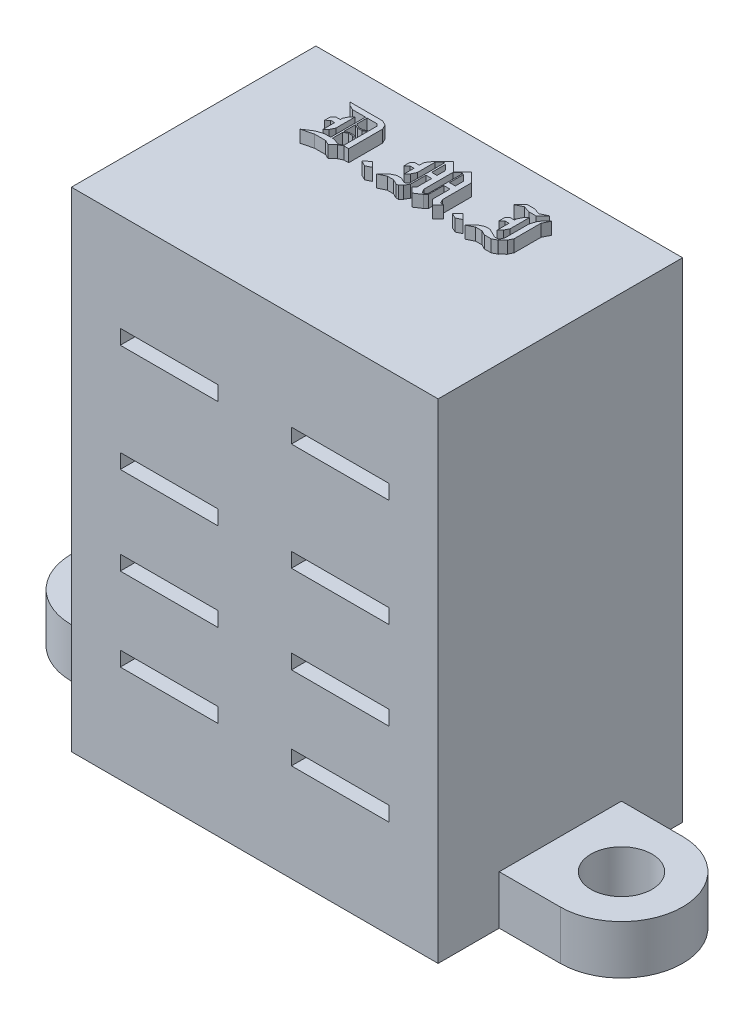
from build123d import *

# Parameters (mm, degrees)
EXTRUDE2_DEPTH     = 10
SKETCH5_R          = 1.25
CUT_EXTRUDE4_DEPTH = 26.617376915
EXTRUDE30_DEPTH    = 0.5
SKETCH3_W          = 4
SKETCH3_H          = 0.6
CUT_EXTRUDE7_DEPTH = 27.009613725


with BuildPart() as part:
    # Sketch1 → Extrude2 (new body)
    with BuildSketch(Plane.XY):
        Polygon((-12.5, 0), (12.5, 0), (12.5, 2), (7.5, 2), (7.5, 20), (-7.5, 20), (-7.5, 2), (-12.5, 2), align=None)
    extrude(amount=-EXTRUDE2_DEPTH)

    # Sketch5 → Cut-Extrude4 (cut, through all)
    with BuildSketch(Plane.XZ):
        with BuildLine():
            ThreePointArc((-12.5, -5), (-11.767766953, -3.232233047), (-10, -2.5))
            Line((-10, -2.5), (-7.5, -2.5))
            Line((-7.5, -2.5), (-7.5, 0))
            Line((-7.5, 0), (-12.5, 0))
            Line((-12.5, 0), (-12.5, -5))
        make_face()
        with BuildLine():
            ThreePointArc((-10, -7.5), (-11.767766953, -6.767766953), (-12.5, -5))
            Line((-12.5, -5), (-12.5, -10))
            Line((-12.5, -10), (-7.5, -10))
            Line((-7.5, -10), (-7.5, -7.5))
            Line((-7.5, -7.5), (-10, -7.5))
        make_face()
        with BuildLine():
            Line((12.5, 0), (7.5, 0))
            Line((7.5, 0), (7.5, -2.5))
            Line((7.5, -2.5), (10, -2.5))
            ThreePointArc((10, -2.5), (11.767766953, -3.232233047), (12.5, -5))
            Line((12.5, -5), (12.5, 0))
        make_face()
        with BuildLine():
            Line((7.5, -7.5), (7.5, -10))
            Line((7.5, -10), (12.5, -10))
            Line((12.5, -10), (12.5, -5))
            ThreePointArc((12.5, -5), (11.767766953, -6.767766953), (10, -7.5))
            Line((10, -7.5), (7.5, -7.5))
        make_face()
        with Locations(Location((-10, -5, 0), (0, 0, 180))):
            Circle(SKETCH5_R)
        with Locations(Location((10, -5, 0), (0, 0, 180))):
            Circle(SKETCH5_R)
    extrude(amount=-CUT_EXTRUDE4_DEPTH, mode=Mode.SUBTRACT)

    # Sketch26 → Extrude30 (add)
    # profile 1 of 8: a face of its own
    with BuildSketch(Plane(origin=(0, 20, 0), x_dir=(1, 0, 0), z_dir=(0, 1, 0))):
        with BuildLine():
            Line((-2.693472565, 6.534178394), (-2.89213957, 6.534178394))
            Line((-2.89213957, 6.534178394), (-3.067011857, 6.445042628))
            Line((-3.067011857, 6.445042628), (-3.2569919, 6.256951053))
            Line((-3.2569919, 6.256951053), (-3.450748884, 6.352507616))
            Line((-3.450748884, 6.352507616), (-3.899449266, 6.352507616))
            add(Edge.make_bspline(
                [(-3.899449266, 6.352507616), (-3.906756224, 6.350637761), (-3.924921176, 6.345989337), (-3.957389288, 6.337019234), (-4.000980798, 6.326419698), (-4.043961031, 6.3151682), (-4.083844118, 6.304986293), (-4.11796231, 6.29692794), (-4.154574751, 6.287141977), (-4.194319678, 6.277541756), (-4.236693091, 6.266873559), (-4.281993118, 6.256083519), (-4.329833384, 6.243737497), (-4.362868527, 6.235755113), (-4.379875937, 6.23164556)],
                knots=[0, 0, 0, 0, 0.548083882, 1.362525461, 2.447565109, 3.80777385, 4.591045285, 5.438673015, 6.355098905, 7.344726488, 8.409796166, 9.530355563, 10.728558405, 12, 12, 12, 12], degree=3))
            Line((-4.379875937, 6.23164556), (-4.254859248, 6.313227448))
            Line((-4.254859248, 6.313227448), (-4.003692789, 6.477146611))
            Line((-4.003692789, 6.477146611), (-3.722310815, 6.570059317))
            Line((-3.722310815, 6.570059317), (-3.465856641, 6.570059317))
            Line((-3.465856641, 6.570059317), (-3.465856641, 7.996231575))
            Line((-3.465856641, 7.996231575), (-3.998782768, 7.996231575))
            add(Edge.make_bspline(
                [(-3.998782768, 7.996231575), (-4.012892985, 8.002503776), (-4.042341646, 8.015594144), (-4.088313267, 8.036582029), (-4.137180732, 8.061504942), (-4.171133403, 8.078703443), (-4.188762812, 8.087633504)],
                knots=[0, 0, 0, 0, 0.878762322, 1.834016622, 2.875346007, 4, 4, 4, 4], degree=3))
            add(Edge.make_bspline(
                [(-4.188762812, 8.087633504), (-4.19768454, 8.096463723), (-4.216730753, 8.115314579), (-4.247346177, 8.144873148), (-4.280946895, 8.178509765), (-4.304925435, 8.201613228), (-4.31755644, 8.213783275)],
                knots=[0, 0, 0, 0, 0.835524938, 1.783688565, 2.832529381, 4, 4, 4, 4], degree=3))
            Line((-4.31755644, 8.213783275), (-2.982786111, 8.213783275))
            Line((-2.982786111, 8.213783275), (-2.79016221, 8.117471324))
            Line((-2.79016221, 8.117471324), (-2.693472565, 7.925602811))
            Line((-2.693472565, 7.925602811), (-2.693472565, 6.534178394))
        make_face()
        Polygon((-2.911024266, 7.572836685), (-2.911024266, 7.917293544), (-2.987696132, 7.996231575), (-3.402404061, 7.996231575), (-3.402404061, 7.572836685), (-3.240373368, 7.490121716), (-3.073054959, 7.490121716), align=None, mode=Mode.SUBTRACT)
        Polygon((-2.911024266, 7.04104364), (-2.911024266, 7.521470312), (-3.063234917, 7.444043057), (-3.251326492, 7.444043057), (-3.402404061, 7.521470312), (-3.402404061, 7.04104364), (-3.251326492, 7.11998167), (-3.063234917, 7.11998167), align=None, mode=Mode.SUBTRACT)
        with BuildLine():
            Line((-2.911024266, 6.562505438), (-2.911024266, 6.993454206))
            Line((-2.911024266, 6.993454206), (-3.070411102, 7.076169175))
            Line((-3.070411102, 7.076169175), (-3.235085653, 7.076169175))
            Line((-3.235085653, 7.076169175), (-3.394472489, 6.993454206))
            Line((-3.394472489, 6.993454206), (-3.394472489, 6.570059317))
            Line((-3.394472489, 6.570059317), (-3.324976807, 6.570059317))
            add(Edge.make_bspline(
                [(-3.324976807, 6.570059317), (-3.323342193, 6.569424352), (-3.317476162, 6.567145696), (-3.304646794, 6.562685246), (-3.283825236, 6.556157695), (-3.255595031, 6.545928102), (-3.219344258, 6.534309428), (-3.175768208, 6.51887197), (-3.124549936, 6.500808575), (-3.087785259, 6.487847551), (-3.068144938, 6.48092355)],
                knots=[0, 0, 0, 0, 0.154799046, 0.555517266, 1.198686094, 2.080896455, 3.205546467, 4.558755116, 6.161627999, 8, 8, 8, 8], degree=3))
            Line((-3.068144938, 6.48092355), (-2.911024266, 6.562505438))
        make_face(mode=Mode.SUBTRACT)
    # profile 2 of 8: a face of its own
    with BuildSketch(Plane(origin=(0, 20, 0), x_dir=(1, 0, 0), z_dir=(0, 1, 0))):
        with BuildLine():
            add(Edge.make_bspline(
                [(-3.684541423, 7.002896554), (-3.690621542, 6.988755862), (-3.703353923, 6.959143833), (-3.725172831, 6.913495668), (-3.749372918, 6.86390405), (-3.766590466, 6.829643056), (-3.775565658, 6.811783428)],
                knots=[0, 0, 0, 0, 0.872337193, 1.826761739, 2.867130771, 4, 4, 4, 4], degree=3))
            add(Edge.make_bspline(
                [(-3.775565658, 6.811783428), (-3.784330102, 6.802670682), (-3.802907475, 6.783355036), (-3.833380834, 6.753773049), (-3.866773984, 6.720311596), (-3.889905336, 6.696610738), (-3.902093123, 6.684122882)],
                knots=[0, 0, 0, 0, 0.844031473, 1.789033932, 2.835053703, 4, 4, 4, 4], degree=3))
            Line((-3.902093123, 6.684122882), (-3.902093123, 7.169837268))
            Line((-3.902093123, 7.169837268), (-4.064123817, 7.169837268))
            Line((-4.064123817, 7.169837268), (-4.192162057, 7.050108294))
            Line((-4.192162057, 7.050108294), (-4.192162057, 7.289566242))
            Line((-4.192162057, 7.289566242), (-4.078476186, 7.394187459))
            Line((-4.078476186, 7.394187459), (-3.894161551, 7.394187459))
            Line((-3.894161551, 7.394187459), (-3.902093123, 7.46934855))
            add(Edge.make_bspline(
                [(-3.902093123, 7.46934855), (-3.895830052, 7.483463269), (-3.882758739, 7.512921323), (-3.861589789, 7.558867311), (-3.837218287, 7.608321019), (-3.820029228, 7.642595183), (-3.811068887, 7.660461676)],
                knots=[0, 0, 0, 0, 0.875251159, 1.826688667, 2.86709268, 4, 4, 4, 4], degree=3))
            add(Edge.make_bspline(
                [(-3.811068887, 7.660461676), (-3.802304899, 7.669574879), (-3.783851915, 7.688763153), (-3.753377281, 7.71834381), (-3.719985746, 7.751806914), (-3.696729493, 7.77563465), (-3.684541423, 7.788122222)],
                knots=[0, 0, 0, 0, 0.844031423, 1.777147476, 2.835053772, 4, 4, 4, 4], degree=3))
            Line((-3.684541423, 7.788122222), (-3.684541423, 7.002896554))
        make_face()
    # profile 3 of 8: a face of its own
    with BuildSketch(Plane(origin=(0, 20, 0), x_dir=(1, 0, 0), z_dir=(0, 1, 0))):
        Polygon((-1.541506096, 6.360439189), (-1.760568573, 6.255817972), (-1.980008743, 6.360439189), (-1.760568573, 6.570059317), align=None)
    # profile 4 of 8: a face of its own
    with BuildSketch(Plane(origin=(0, 20, 0), x_dir=(1, 0, 0), z_dir=(0, 1, 0))):
        with BuildLine():
            Line((1.240965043, 6.48470049), (1.009438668, 6.253929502))
            Line((1.009438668, 6.253929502), (0.811527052, 6.456751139))
            Line((0.811527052, 6.456751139), (0.811527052, 7.174369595))
            Line((0.811527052, 7.174369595), (0.559605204, 7.174369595))
            Line((0.559605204, 7.174369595), (0.559605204, 6.547019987))
            add(Edge.make_bspline(
                [(0.559605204, 6.547019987), (0.553498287, 6.540162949), (0.540106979, 6.525126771), (0.51691133, 6.50208577), (0.490256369, 6.475474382), (0.470660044, 6.457313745), (0.460271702, 6.447686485)],
                knots=[0, 0, 0, 0, 0.783883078, 1.71890636, 2.790753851, 4, 4, 4, 4], degree=3))
            add(Edge.make_bspline(
                [(0.460271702, 6.447686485), (0.451448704, 6.441910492), (0.432751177, 6.429670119), (0.403633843, 6.410144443), (0.371719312, 6.388961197), (0.337475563, 6.365858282), (0.300107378, 6.341210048), (0.260036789, 6.314508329), (0.216801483, 6.286134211), (0.187073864, 6.266643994), (0.171713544, 6.256573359)],
                knots=[0, 0, 0, 0, 0.731243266, 1.549636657, 2.430983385, 3.387392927, 4.414019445, 5.535075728, 6.726368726, 8, 8, 8, 8], degree=3))
            Line((0.171713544, 6.256573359), (-0.037151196, 6.464305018))
            Line((-0.037151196, 6.464305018), (0.062182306, 6.56363852))
            Line((0.062182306, 6.56363852), (0.062182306, 7.174369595))
            Line((0.062182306, 7.174369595), (-0.170854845, 7.174369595))
            Line((-0.170854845, 7.174369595), (-0.170854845, 6.546642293))
            add(Edge.make_bspline(
                [(-0.170854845, 6.546642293), (-0.179177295, 6.533053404), (-0.196701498, 6.504439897), (-0.223933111, 6.459357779), (-0.252366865, 6.409478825), (-0.270805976, 6.37422376), (-0.280386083, 6.355906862)],
                knots=[0, 0, 0, 0, 0.869138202, 1.83010478, 2.872622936, 4, 4, 4, 4], degree=3))
            Line((-0.280386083, 6.355906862), (-0.382363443, 6.255817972))
            Line((-0.382363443, 6.255817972), (-0.486606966, 6.255817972))
            Line((-0.486606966, 6.255817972), (-0.669033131, 6.352507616))
            Line((-0.669033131, 6.352507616), (-0.933041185, 6.352507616))
            Line((-0.933041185, 6.352507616), (-1.228775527, 6.207473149))
            Line((-1.228775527, 6.207473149), (-1.042572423, 6.384989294))
            add(Edge.make_bspline(
                [(-1.042572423, 6.384989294), (-1.037469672, 6.390959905), (-1.02611789, 6.404242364), (-1.005537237, 6.425261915), (-0.979872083, 6.449953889), (-0.961003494, 6.467843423), (-0.950792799, 6.477524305)],
                knots=[0, 0, 0, 0, 0.722559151, 1.60743393, 2.705268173, 4, 4, 4, 4], degree=3))
            Line((-0.950792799, 6.477524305), (-0.760812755, 6.570059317))
            Line((-0.760812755, 6.570059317), (-0.567055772, 6.570059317))
            Line((-0.567055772, 6.570059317), (-0.384629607, 6.478279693))
            Line((-0.384629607, 6.478279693), (-0.306824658, 6.478279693))
            Line((-0.306824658, 6.478279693), (-0.227886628, 6.557217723))
            Line((-0.227886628, 6.557217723), (-0.227886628, 7.996609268))
            Line((-0.227886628, 7.996609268), (-0.286429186, 7.996609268))
            Line((-0.286429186, 7.996609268), (-0.445438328, 7.827024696))
            Line((-0.445438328, 7.827024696), (-0.445438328, 7.096942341))
            add(Edge.make_bspline(
                [(-0.445438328, 7.096942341), (-0.451520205, 7.082676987), (-0.46425144, 7.052815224), (-0.485975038, 7.006867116), (-0.510282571, 6.957200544), (-0.52749174, 6.922935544), (-0.536462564, 6.905073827)],
                knots=[0, 0, 0, 0, 0.876031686, 1.833803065, 2.870801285, 4, 4, 4, 4], degree=3))
            add(Edge.make_bspline(
                [(-0.536462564, 6.905073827), (-0.545241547, 6.895975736), (-0.563911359, 6.876627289), (-0.594252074, 6.846658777), (-0.627665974, 6.812839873), (-0.650802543, 6.788893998), (-0.662990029, 6.776280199)],
                knots=[0, 0, 0, 0, 0.840270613, 1.786960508, 2.834252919, 4, 4, 4, 4], degree=3))
            Line((-0.662990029, 6.776280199), (-0.662990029, 7.174369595))
            Line((-0.662990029, 7.174369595), (-0.825020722, 7.174369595))
            Line((-0.825020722, 7.174369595), (-0.953058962, 7.054640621))
            Line((-0.953058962, 7.054640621), (-0.953058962, 7.290699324))
            Line((-0.953058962, 7.290699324), (-0.842394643, 7.391921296))
            Line((-0.842394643, 7.391921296), (-0.662990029, 7.391921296))
            Line((-0.662990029, 7.391921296), (-0.662990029, 7.557351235))
            add(Edge.make_bspline(
                [(-0.662990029, 7.557351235), (-0.649344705, 7.584923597), (-0.623029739, 7.638096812), (-0.577568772, 7.711015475), (-0.53111895, 7.776136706), (-0.495724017, 7.813285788), (-0.478675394, 7.83117933)],
                knots=[0, 0, 0, 0, 1.112484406, 2.145422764, 3.106708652, 4, 4, 4, 4], degree=3))
            Line((-0.478675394, 7.83117933), (-0.091161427, 8.213783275))
            Line((-0.091161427, 8.213783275), (0.275957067, 7.851574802))
            Line((0.275957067, 7.851574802), (0.641564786, 8.213783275))
            Line((0.641564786, 8.213783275), (1.029078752, 7.833067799))
            Line((1.029078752, 7.833067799), (1.029078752, 6.651641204))
            Line((1.029078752, 6.651641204), (1.113304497, 6.48470049))
            Line((1.113304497, 6.48470049), (1.240965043, 6.48470049))
        make_face()
        Polygon((0.811527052, 7.391921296), (0.811527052, 7.728446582), (0.56980294, 7.960350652), (0.56980294, 7.391921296), align=None, mode=Mode.SUBTRACT)
        Polygon((0.521458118, 6.559106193), (0.521458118, 7.992076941), (0.456494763, 7.992076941), (0.279734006, 7.822492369), (0.279734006, 6.647108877), (0.367358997, 6.480168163), (0.440253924, 6.480168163), align=None, mode=Mode.SUBTRACT)
        Polygon((0.062182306, 7.391921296), (0.062182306, 7.728446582), (-0.155369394, 7.960350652), (-0.155369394, 7.391921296), align=None, mode=Mode.SUBTRACT)
    # profile 5 of 8: a face of its own
    with BuildSketch(Plane(origin=(0, 20, 0), x_dir=(1, 0, 0), z_dir=(0, 1, 0))):
        Polygon((2.15687281, 6.360439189), (1.937810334, 6.255817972), (1.718370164, 6.360439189), (1.937810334, 6.570059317), align=None)
    # profile 6 of 8: a face of its own
    with BuildSketch(Plane(origin=(0, 20, 0), x_dir=(1, 0, 0), z_dir=(0, 1, 0))):
        with BuildLine():
            Line((3.796442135, 8.262128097), (3.513549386, 7.983012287))
            Line((3.513549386, 7.983012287), (3.229145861, 7.983012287))
            Line((3.229145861, 7.983012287), (2.960227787, 8.072148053))
            Line((2.960227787, 8.072148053), (2.668270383, 7.928246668))
            Line((2.668270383, 7.928246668), (2.950030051, 8.207362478))
            Line((2.950030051, 8.207362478), (3.234433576, 8.207362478))
            add(Edge.make_bspline(
                [(3.234433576, 8.207362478), (3.240984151, 8.205233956), (3.255486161, 8.200521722), (3.279095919, 8.192537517), (3.306756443, 8.183614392), (3.33811346, 8.172812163), (3.37371736, 8.161280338), (3.413278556, 8.147895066), (3.457076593, 8.13375387), (3.487498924, 8.123545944), (3.50335165, 8.118226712)],
                knots=[0, 0, 0, 0, 0.583480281, 1.291739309, 2.111303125, 3.045536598, 4.101185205, 5.28161692, 6.583481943, 8, 8, 8, 8], degree=3))
            Line((3.50335165, 8.118226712), (3.796442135, 8.262128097))
        make_face()
    # profile 7 of 8: a face of its own
    with BuildSketch(Plane(origin=(0, 20, 0), x_dir=(1, 0, 0), z_dir=(0, 1, 0))):
        with BuildLine():
            add(Edge.make_bspline(
                [(3.446319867, 7.002896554), (3.440087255, 6.988767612), (3.427058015, 6.959231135), (3.405339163, 6.913483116), (3.381102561, 6.863907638), (3.363890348, 6.829644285), (3.354917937, 6.811783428)],
                knots=[0, 0, 0, 0, 0.874591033, 1.828327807, 2.867947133, 4, 4, 4, 4], degree=3))
            add(Edge.make_bspline(
                [(3.354917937, 6.811783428), (3.346157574, 6.802666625), (3.327588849, 6.783342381), (3.297105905, 6.753895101), (3.264099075, 6.720174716), (3.240981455, 6.696585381), (3.228768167, 6.684122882)],
                knots=[0, 0, 0, 0, 0.845283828, 1.791688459, 2.833325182, 4, 4, 4, 4], degree=3))
            Line((3.228768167, 6.684122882), (3.228768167, 7.169837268))
            Line((3.228768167, 7.169837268), (3.065604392, 7.169837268))
            Line((3.065604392, 7.169837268), (2.938699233, 7.050108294))
            Line((2.938699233, 7.050108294), (2.938699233, 7.289566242))
            Line((2.938699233, 7.289566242), (3.049363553, 7.394187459))
            Line((3.049363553, 7.394187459), (3.228768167, 7.394187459))
            Line((3.228768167, 7.394187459), (3.228768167, 7.46934855))
            add(Edge.make_bspline(
                [(3.228768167, 7.46934855), (3.235038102, 7.483459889), (3.248123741, 7.512910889), (3.269197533, 7.558965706), (3.294110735, 7.608214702), (3.311249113, 7.642575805), (3.320170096, 7.660461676)],
                knots=[0, 0, 0, 0, 0.874561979, 1.825250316, 2.867984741, 4, 4, 4, 4], degree=3))
            add(Edge.make_bspline(
                [(3.320170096, 7.660461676), (3.32893007, 7.669578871), (3.347374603, 7.688775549), (3.377857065, 7.718223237), (3.410864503, 7.751943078), (3.434106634, 7.775659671), (3.446319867, 7.788122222)],
                knots=[0, 0, 0, 0, 0.845283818, 1.779784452, 2.833325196, 4, 4, 4, 4], degree=3))
            Line((3.446319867, 7.788122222), (3.446319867, 7.002896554))
        make_face()
    # profile 8 of 8: a face of its own
    with BuildSketch(Plane(origin=(0, 20, 0), x_dir=(1, 0, 0), z_dir=(0, 1, 0))):
        with BuildLine():
            Line((4.028346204, 8.117471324), (3.881423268, 7.823247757))
            Line((3.881423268, 7.823247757), (3.881423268, 6.726802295))
            Line((3.881423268, 6.726802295), (3.79115442, 6.536822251))
            add(Edge.make_bspline(
                [(3.79115442, 6.536822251), (3.778417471, 6.524253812), (3.751486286, 6.497678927), (3.709416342, 6.45526918), (3.662263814, 6.409002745), (3.629142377, 6.376912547), (3.611749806, 6.360061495)],
                knots=[0, 0, 0, 0, 0.852572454, 1.802691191, 2.846159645, 4, 4, 4, 4], degree=3))
            Line((3.611749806, 6.360061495), (3.606839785, 6.352507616))
            Line((3.606839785, 6.352507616), (3.598908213, 6.352507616))
            Line((3.598908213, 6.352507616), (3.416859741, 6.255817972))
            Line((3.416859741, 6.255817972), (3.131323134, 6.255817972))
            Line((3.131323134, 6.255817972), (2.948896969, 6.352507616))
            Line((2.948896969, 6.352507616), (2.684888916, 6.352507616))
            Line((2.684888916, 6.352507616), (2.390665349, 6.207473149))
            Line((2.390665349, 6.207473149), (2.575357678, 6.384989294))
            add(Edge.make_bspline(
                [(2.575357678, 6.384989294), (2.580460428, 6.390959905), (2.591812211, 6.404242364), (2.612392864, 6.425261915), (2.638058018, 6.449953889), (2.656926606, 6.467843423), (2.667137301, 6.477524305)],
                knots=[0, 0, 0, 0, 0.722559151, 1.60743393, 2.705268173, 4, 4, 4, 4], degree=3))
            Line((2.667137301, 6.477524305), (2.857117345, 6.570059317))
            Line((2.857117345, 6.570059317), (3.050874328, 6.570059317))
            Line((3.050874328, 6.570059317), (3.416859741, 6.392165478))
            Line((3.416859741, 6.392165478), (3.581156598, 6.392165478))
            Line((3.581156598, 6.392165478), (3.663871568, 6.555329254))
            Line((3.663871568, 6.555329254), (3.663871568, 7.556595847))
            add(Edge.make_bspline(
                [(3.663871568, 7.556595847), (3.671033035, 7.579010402), (3.685525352, 7.624369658), (3.707915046, 7.693494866), (3.731492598, 7.764911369), (3.747240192, 7.813545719), (3.755273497, 7.838355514)],
                knots=[0, 0, 0, 0, 0.953258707, 1.929063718, 2.943555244, 4, 4, 4, 4], degree=3))
            Line((3.755273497, 7.838355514), (4.028346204, 8.117471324))
        make_face()
    extrude(amount=EXTRUDE30_DEPTH)

    # Sketch3 → Cut-Extrude7 (cut, through all)
    with BuildSketch(Plane.XY):
        with Locations((-3.5, 15.7)):
            Rectangle(SKETCH3_W, SKETCH3_H)
        with Locations((3.5, 15.7)):
            Rectangle(SKETCH3_W, SKETCH3_H)
        with Locations((-3.5, 11.3)):
            Rectangle(SKETCH3_W, SKETCH3_H)
        with Locations((-3.5, 7.7)):
            Rectangle(SKETCH3_W, SKETCH3_H)
        with Locations((-3.5, 4.3)):
            Rectangle(SKETCH3_W, SKETCH3_H)
        with Locations((3.5, 4.3)):
            Rectangle(SKETCH3_W, SKETCH3_H)
        with Locations((3.5, 7.7)):
            Rectangle(SKETCH3_W, SKETCH3_H)
        with Locations((3.5, 11.3)):
            Rectangle(SKETCH3_W, SKETCH3_H)
    extrude(amount=-CUT_EXTRUDE7_DEPTH, mode=Mode.SUBTRACT)


solid = part.part
